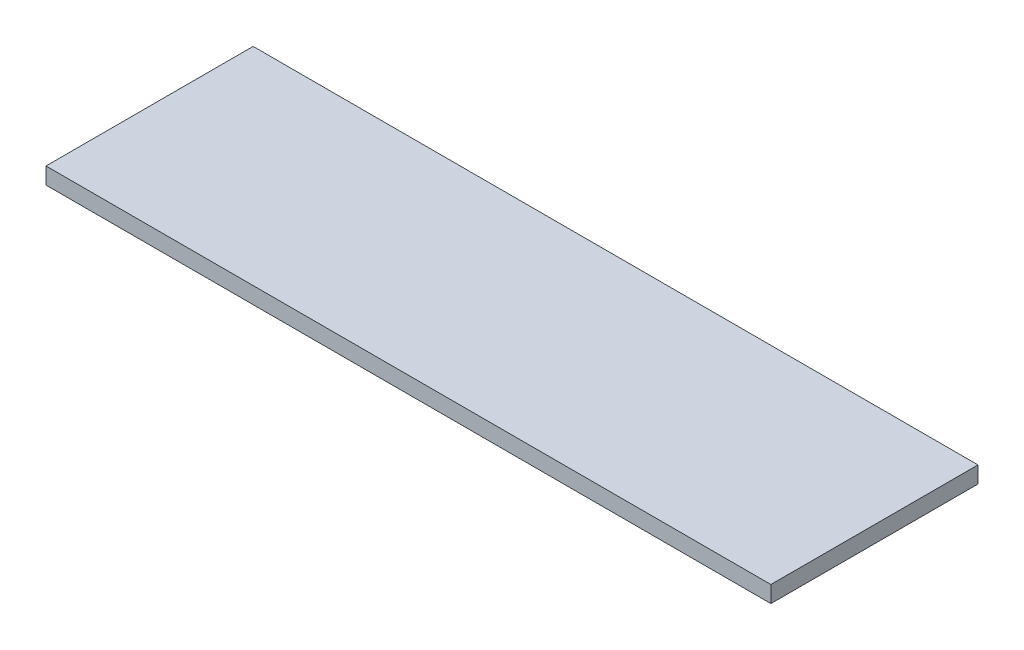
from build123d import *

# Parameters (mm, degrees)
SKETCH1_W           = 88.9
SKETCH1_H           = 25.4
BOSS_EXTRUDE1_DEPTH = 2.032


with BuildPart() as part:
    # Sketch1 → Boss-Extrude1 (new body)
    with BuildSketch(Plane(origin=(0, 0, 0), x_dir=(1, 0, 0), z_dir=(0, 1, 0))):
        Rectangle(SKETCH1_W, SKETCH1_H)
    extrude(amount=BOSS_EXTRUDE1_DEPTH)


solid = part.part
